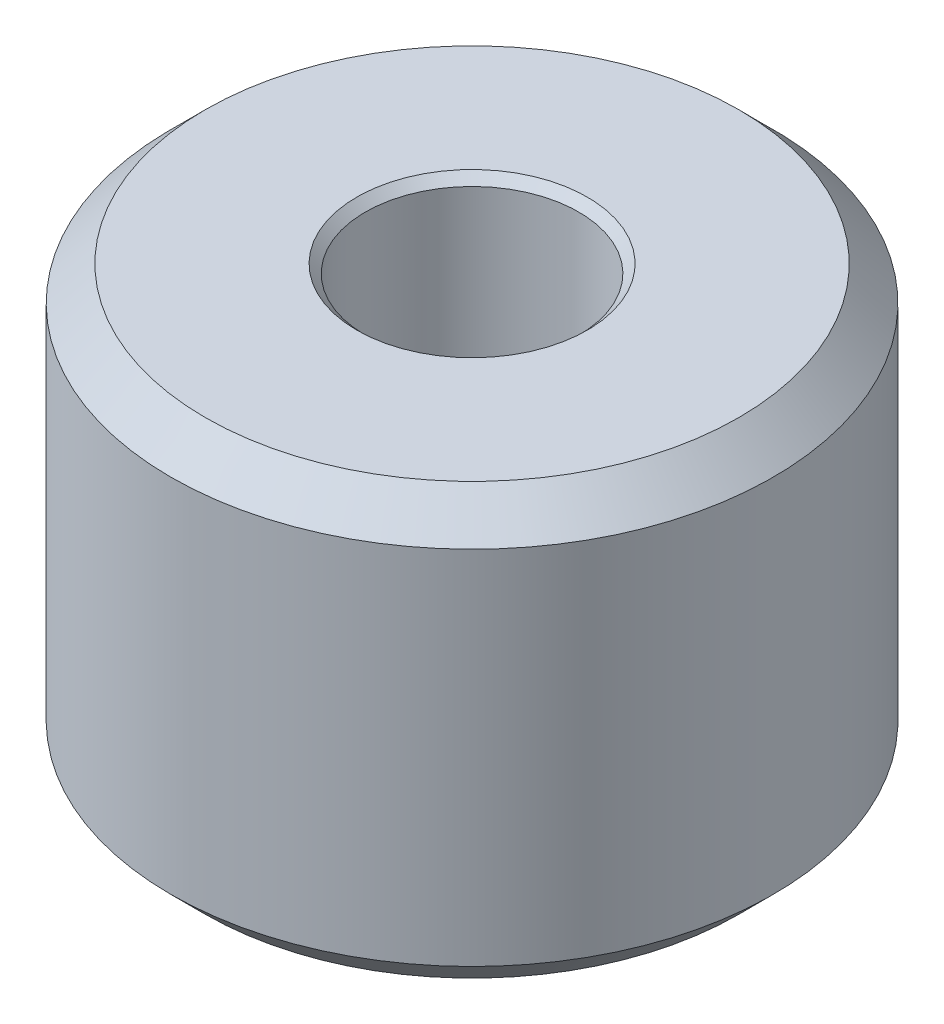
ISO-10303-21;
HEADER;
FILE_DESCRIPTION(('STEP AP214'),'2;1');
FILE_NAME('part.step','',(''),(''),'','','');
FILE_SCHEMA(('AUTOMOTIVE_DESIGN { 1 0 10303 214 1 1 1 1 }'));
ENDSEC;
DATA;
#1=APPLICATION_CONTEXT('core data for automotive mechanical design processes');
#2=APPLICATION_PROTOCOL_DEFINITION('international standard','automotive_design',2000,#1);
#3=PRODUCT_CONTEXT('',#1,'mechanical');
#4=PRODUCT('Part','Part','',(#3));
#5=PRODUCT_RELATED_PRODUCT_CATEGORY('part','',(#4));
#6=PRODUCT_DEFINITION_FORMATION('','',#4);
#7=PRODUCT_DEFINITION_CONTEXT('part definition',#1,'design');
#8=PRODUCT_DEFINITION('design','',#6,#7);
#9=PRODUCT_DEFINITION_SHAPE('','',#8);
#10=(LENGTH_UNIT() NAMED_UNIT(*) SI_UNIT(.MILLI.,.METRE.));
#11=(NAMED_UNIT(*) PLANE_ANGLE_UNIT() SI_UNIT($,.RADIAN.));
#12=(NAMED_UNIT(*) SI_UNIT($,.STERADIAN.) SOLID_ANGLE_UNIT());
#13=UNCERTAINTY_MEASURE_WITH_UNIT(LENGTH_MEASURE(1.E-05),#10,'distance_accuracy_value','');
#14=(GEOMETRIC_REPRESENTATION_CONTEXT(3) GLOBAL_UNCERTAINTY_ASSIGNED_CONTEXT((#13)) GLOBAL_UNIT_ASSIGNED_CONTEXT((#10,
#11,#12)) REPRESENTATION_CONTEXT('',''));
#15=CARTESIAN_POINT('',(0.,0.,0.));
#16=DIRECTION('',(0.,0.,1.));
#17=DIRECTION('',(1.,0.,0.));
#18=AXIS2_PLACEMENT_3D('',#15,#16,#17);
#19=CARTESIAN_POINT('',(0.,25.,0.));
#20=DIRECTION('',(0.,-1.,0.));
#21=DIRECTION('',(0.,0.,-1.));
#22=AXIS2_PLACEMENT_3D('',#19,#20,#21);
#23=CYLINDRICAL_SURFACE('',#22,17.5);
#24=CARTESIAN_POINT('',(0.,2.,0.));
#25=DIRECTION('',(0.,1.,0.));
#26=DIRECTION('',(0.,0.,1.));
#27=AXIS2_PLACEMENT_3D('',#24,#25,#26);
#28=CIRCLE('',#27,17.5);
#29=CARTESIAN_POINT('',(0.,2.,17.5));
#30=VERTEX_POINT('',#29);
#31=EDGE_CURVE('E57',#30,#30,#28,.T.);
#32=ORIENTED_EDGE('',*,*,#31,.T.);
#33=EDGE_LOOP('',(#32));
#34=FACE_BOUND('',#33,.T.);
#35=CARTESIAN_POINT('',(0.,23.,0.));
#36=DIRECTION('',(0.,1.,0.));
#37=DIRECTION('',(0.,0.,1.));
#38=AXIS2_PLACEMENT_3D('',#35,#36,#37);
#39=CIRCLE('',#38,17.5);
#40=CARTESIAN_POINT('',(0.,23.,17.5));
#41=VERTEX_POINT('',#40);
#42=EDGE_CURVE('E60',#41,#41,#39,.F.);
#43=ORIENTED_EDGE('',*,*,#42,.T.);
#44=EDGE_LOOP('',(#43));
#45=FACE_BOUND('',#44,.T.);
#46=ADVANCED_FACE('F31',(#34,#45),#23,.T.);
#47=CARTESIAN_POINT('',(0.,25.,0.));
#48=DIRECTION('',(0.,1.,0.));
#49=DIRECTION('',(0.,0.,1.));
#50=AXIS2_PLACEMENT_3D('',#47,#48,#49);
#51=PLANE('',#50);
#52=CARTESIAN_POINT('',(0.,25.,0.));
#53=DIRECTION('',(0.,1.,0.));
#54=DIRECTION('',(0.,0.,1.));
#55=AXIS2_PLACEMENT_3D('',#52,#53,#54);
#56=CIRCLE('',#55,6.70000000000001);
#57=CARTESIAN_POINT('',(0.,25.,6.70000000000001));
#58=VERTEX_POINT('',#57);
#59=EDGE_CURVE('E10',#58,#58,#56,.F.);
#60=ORIENTED_EDGE('',*,*,#59,.T.);
#61=EDGE_LOOP('',(#60));
#62=FACE_BOUND('',#61,.T.);
#63=CARTESIAN_POINT('',(0.,25.,0.));
#64=DIRECTION('',(0.,1.,0.));
#65=DIRECTION('',(0.,0.,1.));
#66=AXIS2_PLACEMENT_3D('',#63,#64,#65);
#67=CIRCLE('',#66,15.5);
#68=CARTESIAN_POINT('',(0.,25.,15.5));
#69=VERTEX_POINT('',#68);
#70=EDGE_CURVE('E51',#69,#69,#67,.T.);
#71=ORIENTED_EDGE('',*,*,#70,.T.);
#72=EDGE_LOOP('',(#71));
#73=FACE_BOUND('',#72,.T.);
#74=ADVANCED_FACE('F73',(#62,#73),#51,.T.);
#75=CARTESIAN_POINT('',(0.,0.,0.));
#76=DIRECTION('',(0.,1.,0.));
#77=DIRECTION('',(0.,0.,1.));
#78=AXIS2_PLACEMENT_3D('',#75,#76,#77);
#79=PLANE('',#78);
#80=CARTESIAN_POINT('',(0.,0.,0.));
#81=DIRECTION('',(0.,1.,0.));
#82=DIRECTION('',(0.,0.,1.));
#83=AXIS2_PLACEMENT_3D('',#80,#81,#82);
#84=CIRCLE('',#83,6.69999999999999);
#85=CARTESIAN_POINT('',(0.,0.,6.69999999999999));
#86=VERTEX_POINT('',#85);
#87=EDGE_CURVE('E46',#86,#86,#84,.T.);
#88=ORIENTED_EDGE('',*,*,#87,.T.);
#89=EDGE_LOOP('',(#88));
#90=FACE_BOUND('',#89,.T.);
#91=CARTESIAN_POINT('',(0.,0.,0.));
#92=DIRECTION('',(0.,1.,0.));
#93=DIRECTION('',(0.,0.,1.));
#94=AXIS2_PLACEMENT_3D('',#91,#92,#93);
#95=CIRCLE('',#94,15.5);
#96=CARTESIAN_POINT('',(0.,0.,15.5));
#97=VERTEX_POINT('',#96);
#98=EDGE_CURVE('E54',#97,#97,#95,.F.);
#99=ORIENTED_EDGE('',*,*,#98,.T.);
#100=EDGE_LOOP('',(#99));
#101=FACE_BOUND('',#100,.T.);
#102=ADVANCED_FACE('F75',(#90,#101),#79,.F.);
#103=CARTESIAN_POINT('',(0.,2.,0.));
#104=DIRECTION('',(0.,1.,0.));
#105=DIRECTION('',(0.,0.,1.));
#106=AXIS2_PLACEMENT_3D('',#103,#104,#105);
#107=CONICAL_SURFACE('',#106,17.5,0.785398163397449);
#108=ORIENTED_EDGE('',*,*,#98,.F.);
#109=EDGE_LOOP('',(#108));
#110=FACE_BOUND('',#109,.T.);
#111=ORIENTED_EDGE('',*,*,#31,.F.);
#112=EDGE_LOOP('',(#111));
#113=FACE_BOUND('',#112,.T.);
#114=ADVANCED_FACE('F69',(#110,#113),#107,.T.);
#115=CARTESIAN_POINT('',(0.,25.,0.));
#116=DIRECTION('',(0.,-1.,0.));
#117=DIRECTION('',(0.,0.,-1.));
#118=AXIS2_PLACEMENT_3D('',#115,#116,#117);
#119=CONICAL_SURFACE('',#118,15.5,0.785398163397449);
#120=ORIENTED_EDGE('',*,*,#42,.F.);
#121=EDGE_LOOP('',(#120));
#122=FACE_BOUND('',#121,.T.);
#123=ORIENTED_EDGE('',*,*,#70,.F.);
#124=EDGE_LOOP('',(#123));
#125=FACE_BOUND('',#124,.T.);
#126=ADVANCED_FACE('F65',(#122,#125),#119,.T.);
#127=CARTESIAN_POINT('',(0.,-1.7,0.));
#128=DIRECTION('',(0.,1.,0.));
#129=DIRECTION('',(0.,0.,1.));
#130=AXIS2_PLACEMENT_3D('',#127,#128,#129);
#131=CYLINDRICAL_SURFACE('',#130,6.2);
#132=CARTESIAN_POINT('',(0.,0.499999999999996,0.));
#133=DIRECTION('',(0.,1.,0.));
#134=DIRECTION('',(0.,0.,1.));
#135=AXIS2_PLACEMENT_3D('',#132,#133,#134);
#136=CIRCLE('',#135,6.2);
#137=CARTESIAN_POINT('',(0.,0.499999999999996,6.2));
#138=VERTEX_POINT('',#137);
#139=EDGE_CURVE('E38',#138,#138,#136,.F.);
#140=ORIENTED_EDGE('',*,*,#139,.T.);
#141=EDGE_LOOP('',(#140));
#142=FACE_BOUND('',#141,.T.);
#143=CARTESIAN_POINT('',(0.,24.5,0.));
#144=DIRECTION('',(0.,1.,0.));
#145=DIRECTION('',(0.,0.,1.));
#146=AXIS2_PLACEMENT_3D('',#143,#144,#145);
#147=CIRCLE('',#146,6.2);
#148=CARTESIAN_POINT('',(0.,24.5,6.2));
#149=VERTEX_POINT('',#148);
#150=EDGE_CURVE('E42',#149,#149,#147,.T.);
#151=ORIENTED_EDGE('',*,*,#150,.T.);
#152=EDGE_LOOP('',(#151));
#153=FACE_BOUND('',#152,.T.);
#154=ADVANCED_FACE('F68',(#142,#153),#131,.F.);
#155=CARTESIAN_POINT('',(0.,0.,0.));
#156=DIRECTION('',(0.,-1.,0.));
#157=DIRECTION('',(0.,0.,-1.));
#158=AXIS2_PLACEMENT_3D('',#155,#156,#157);
#159=CONICAL_SURFACE('',#158,6.69999999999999,0.785398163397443);
#160=ORIENTED_EDGE('',*,*,#139,.F.);
#161=EDGE_LOOP('',(#160));
#162=FACE_BOUND('',#161,.T.);
#163=ORIENTED_EDGE('',*,*,#87,.F.);
#164=EDGE_LOOP('',(#163));
#165=FACE_BOUND('',#164,.T.);
#166=ADVANCED_FACE('F89',(#162,#165),#159,.F.);
#167=CARTESIAN_POINT('',(0.,24.5,0.));
#168=DIRECTION('',(0.,1.,0.));
#169=DIRECTION('',(0.,0.,1.));
#170=AXIS2_PLACEMENT_3D('',#167,#168,#169);
#171=CONICAL_SURFACE('',#170,6.2,0.785398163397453);
#172=ORIENTED_EDGE('',*,*,#59,.F.);
#173=EDGE_LOOP('',(#172));
#174=FACE_BOUND('',#173,.T.);
#175=ORIENTED_EDGE('',*,*,#150,.F.);
#176=EDGE_LOOP('',(#175));
#177=FACE_BOUND('',#176,.T.);
#178=ADVANCED_FACE('F33',(#174,#177),#171,.F.);
#179=CLOSED_SHELL('',(#46,#74,#102,#114,#126,#154,#166,#178));
#180=MANIFOLD_SOLID_BREP('B2',#179);
#181=ADVANCED_BREP_SHAPE_REPRESENTATION('',(#18,#180),#14);
#182=SHAPE_DEFINITION_REPRESENTATION(#9,#181);
ENDSEC;
END-ISO-10303-21;
